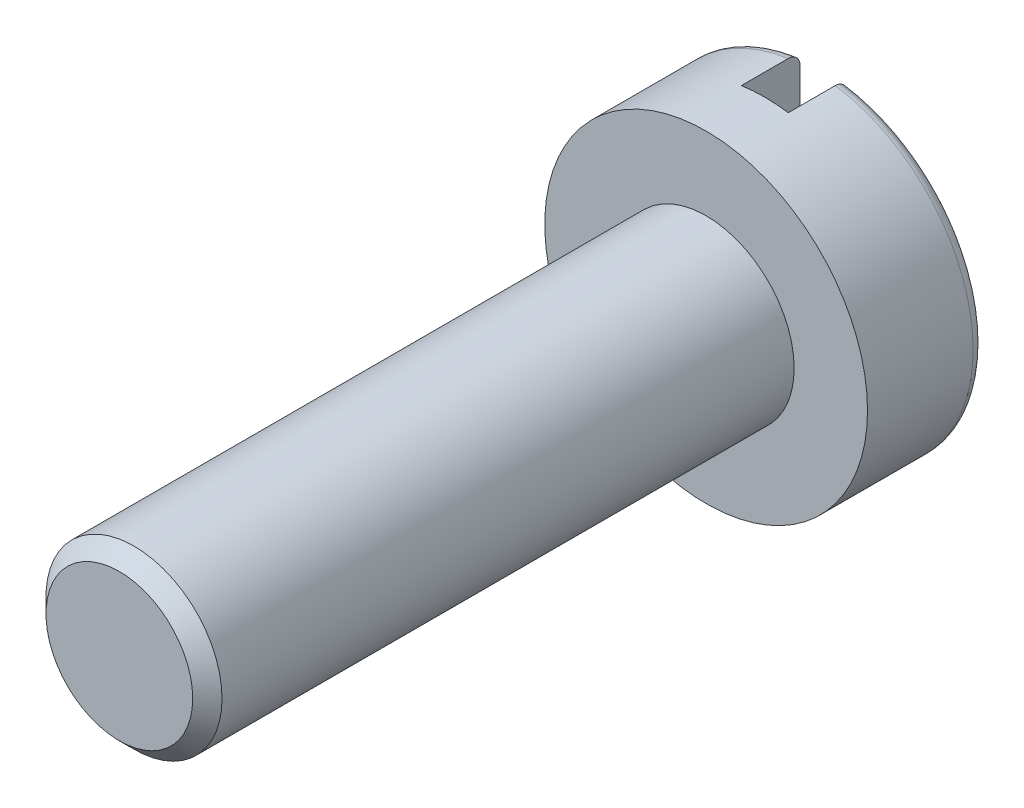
ISO-10303-21;
HEADER;
FILE_DESCRIPTION(('STEP AP214'),'2;1');
FILE_NAME('part.step','',(''),(''),'','','');
FILE_SCHEMA(('AUTOMOTIVE_DESIGN { 1 0 10303 214 1 1 1 1 }'));
ENDSEC;
DATA;
#1=APPLICATION_CONTEXT('core data for automotive mechanical design processes');
#2=APPLICATION_PROTOCOL_DEFINITION('international standard','automotive_design',2000,#1);
#3=PRODUCT_CONTEXT('',#1,'mechanical');
#4=PRODUCT('Part','Part','',(#3));
#5=PRODUCT_RELATED_PRODUCT_CATEGORY('part','',(#4));
#6=PRODUCT_DEFINITION_FORMATION('','',#4);
#7=PRODUCT_DEFINITION_CONTEXT('part definition',#1,'design');
#8=PRODUCT_DEFINITION('design','',#6,#7);
#9=PRODUCT_DEFINITION_SHAPE('','',#8);
#10=(LENGTH_UNIT() NAMED_UNIT(*) SI_UNIT(.MILLI.,.METRE.));
#11=(NAMED_UNIT(*) PLANE_ANGLE_UNIT() SI_UNIT($,.RADIAN.));
#12=(NAMED_UNIT(*) SI_UNIT($,.STERADIAN.) SOLID_ANGLE_UNIT());
#13=UNCERTAINTY_MEASURE_WITH_UNIT(LENGTH_MEASURE(1.E-05),#10,'distance_accuracy_value','');
#14=(GEOMETRIC_REPRESENTATION_CONTEXT(3) GLOBAL_UNCERTAINTY_ASSIGNED_CONTEXT((#13)) GLOBAL_UNIT_ASSIGNED_CONTEXT((#10,
#11,#12)) REPRESENTATION_CONTEXT('',''));
#15=CARTESIAN_POINT('',(0.,0.,0.));
#16=DIRECTION('',(0.,0.,1.));
#17=DIRECTION('',(1.,0.,0.));
#18=AXIS2_PLACEMENT_3D('',#15,#16,#17);
#19=CARTESIAN_POINT('',(0.,0.,-2.));
#20=DIRECTION('',(0.,0.,1.));
#21=DIRECTION('',(1.,0.,0.));
#22=AXIS2_PLACEMENT_3D('',#19,#20,#21);
#23=PLANE('',#22);
#24=CARTESIAN_POINT('',(0.,0.,-2.));
#25=DIRECTION('',(0.,0.,1.));
#26=DIRECTION('',(1.,0.,0.));
#27=AXIS2_PLACEMENT_3D('',#24,#25,#26);
#28=CIRCLE('',#27,2.55);
#29=CARTESIAN_POINT('',(0.4,2.51843205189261,-2.));
#30=VERTEX_POINT('',#29);
#31=CARTESIAN_POINT('',(0.399999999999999,-2.51843205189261,-2.));
#32=VERTEX_POINT('',#31);
#33=EDGE_CURVE('E92',#30,#32,#28,.F.);
#34=ORIENTED_EDGE('',*,*,#33,.T.);
#35=DIRECTION('',(0.,-1.,0.));
#36=VECTOR('',#35,1.);
#37=CARTESIAN_POINT('',(0.4,2.75,-2.));
#38=LINE('',#37,#36);
#39=EDGE_CURVE('E80',#30,#32,#38,.T.);
#40=ORIENTED_EDGE('',*,*,#39,.F.);
#41=EDGE_LOOP('',(#34,#40));
#42=FACE_BOUND('',#41,.T.);
#43=ADVANCED_FACE('F26',(#42),#23,.F.);
#44=CARTESIAN_POINT('',(0.,0.,-1.8));
#45=DIRECTION('',(0.,0.,1.));
#46=DIRECTION('',(1.,0.,0.));
#47=AXIS2_PLACEMENT_3D('',#44,#45,#46);
#48=TOROIDAL_SURFACE('',#47,2.55,0.2);
#49=CARTESIAN_POINT('',(0.400000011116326,-2.65860933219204,-1.94425299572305));
#50=CARTESIAN_POINT('',(0.400000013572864,-2.66673946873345,-1.93653155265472));
#51=CARTESIAN_POINT('',(0.400000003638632,-2.67422805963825,-1.92812356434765));
#52=CARTESIAN_POINT('',(0.399999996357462,-2.68769669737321,-1.91016516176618));
#53=CARTESIAN_POINT('',(0.399999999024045,-2.69367511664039,-1.90061353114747));
#54=CARTESIAN_POINT('',(0.400000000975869,-2.703938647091,-1.88063967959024));
#55=CARTESIAN_POINT('',(0.400000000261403,-2.70822390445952,-1.87021753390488));
#56=CARTESIAN_POINT('',(0.399999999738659,-2.71497066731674,-1.84880138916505));
#57=CARTESIAN_POINT('',(0.399999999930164,-2.71743261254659,-1.83780752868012));
#58=CARTESIAN_POINT('',(0.400000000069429,-2.72045091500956,-1.81562649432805));
#59=CARTESIAN_POINT('',(0.400000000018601,-2.72101827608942,-1.80444081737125));
#60=CARTESIAN_POINT('',(0.399999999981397,-2.72026107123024,-1.78213351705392));
#61=CARTESIAN_POINT('',(0.399999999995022,-2.718936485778,-1.77101189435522));
#62=CARTESIAN_POINT('',(0.400000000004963,-2.71444187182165,-1.74918151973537));
#63=CARTESIAN_POINT('',(0.40000000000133,-2.7112771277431,-1.73847167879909));
#64=CARTESIAN_POINT('',(0.399999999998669,-2.70320081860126,-1.71773257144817));
#65=CARTESIAN_POINT('',(0.399999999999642,-2.69828924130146,-1.70770330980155));
#66=CARTESIAN_POINT('',(0.400000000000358,-2.68684325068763,-1.68856900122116));
#67=CARTESIAN_POINT('',(0.400000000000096,-2.68030303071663,-1.67946742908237));
#68=CARTESIAN_POINT('',(0.399999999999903,-2.66579978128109,-1.66247936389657));
#69=CARTESIAN_POINT('',(0.399999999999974,-2.65783669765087,-1.65459291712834));
#70=CARTESIAN_POINT('',(0.400000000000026,-2.64063985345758,-1.64018295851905));
#71=CARTESIAN_POINT('',(0.400000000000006,-2.63139548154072,-1.63367211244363));
#72=CARTESIAN_POINT('',(0.399999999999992,-2.61195448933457,-1.62227505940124));
#73=CARTESIAN_POINT('',(0.399999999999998,-2.60175781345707,-1.61738894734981));
#74=CARTESIAN_POINT('',(0.400000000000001,-2.58058150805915,-1.609323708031));
#75=CARTESIAN_POINT('',(0.4,-2.56959449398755,-1.60616396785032));
#76=CARTESIAN_POINT('',(0.399999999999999,-2.54724795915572,-1.60171557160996));
#77=CARTESIAN_POINT('',(0.399999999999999,-2.53588841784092,-1.60042701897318));
#78=CARTESIAN_POINT('',(0.4,-2.51301035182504,-1.59974960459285));
#79=CARTESIAN_POINT('',(0.4,-2.50149131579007,-1.60037791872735));
#80=CARTESIAN_POINT('',(0.399999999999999,-2.47872055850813,-1.60355343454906));
#81=CARTESIAN_POINT('',(0.399999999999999,-2.46746884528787,-1.60610069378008));
#82=CARTESIAN_POINT('',(0.399999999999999,-2.4455202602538,-1.61305571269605));
#83=CARTESIAN_POINT('',(0.399999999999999,-2.43482505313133,-1.61746873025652));
#84=CARTESIAN_POINT('',(0.399999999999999,-2.41433282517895,-1.62803723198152));
#85=CARTESIAN_POINT('',(0.399999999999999,-2.40453578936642,-1.63419268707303));
#86=CARTESIAN_POINT('',(0.399999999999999,-2.38617960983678,-1.64803967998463));
#87=CARTESIAN_POINT('',(0.399999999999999,-2.37761393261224,-1.65572255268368));
#88=CARTESIAN_POINT('',(0.399999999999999,-2.36191367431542,-1.67243328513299));
#89=CARTESIAN_POINT('',(0.399999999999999,-2.35477900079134,-1.68146105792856));
#90=CARTESIAN_POINT('',(0.399999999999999,-2.34223853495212,-1.70048776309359));
#91=CARTESIAN_POINT('',(0.399999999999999,-2.33681259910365,-1.71047341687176));
#92=CARTESIAN_POINT('',(0.399999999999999,-2.32774037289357,-1.7312228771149));
#93=CARTESIAN_POINT('',(0.399999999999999,-2.32409393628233,-1.74198661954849));
#94=CARTESIAN_POINT('',(0.399999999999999,-2.31873231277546,-1.7638322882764));
#95=CARTESIAN_POINT('',(0.399999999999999,-2.31699201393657,-1.77490805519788));
#96=CARTESIAN_POINT('',(0.4,-2.31541092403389,-1.79719413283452));
#97=CARTESIAN_POINT('',(0.4,-2.31557003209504,-1.80840443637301));
#98=CARTESIAN_POINT('',(0.399999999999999,-2.31777431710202,-1.83055416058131));
#99=CARTESIAN_POINT('',(0.399999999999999,-2.31980560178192,-1.84149496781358));
#100=CARTESIAN_POINT('',(0.4,-2.32567160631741,-1.86288155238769));
#101=CARTESIAN_POINT('',(0.400000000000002,-2.3295063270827,-1.87332732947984));
#102=CARTESIAN_POINT('',(0.399999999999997,-2.33887482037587,-1.89345961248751));
#103=CARTESIAN_POINT('',(0.399999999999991,-2.34441300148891,-1.90314406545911));
#104=CARTESIAN_POINT('',(0.400000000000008,-2.3570198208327,-1.92145915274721));
#105=CARTESIAN_POINT('',(0.400000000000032,-2.36408853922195,-1.93008973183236));
#106=CARTESIAN_POINT('',(0.399999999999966,-2.37963706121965,-1.94615549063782));
#107=CARTESIAN_POINT('',(0.399999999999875,-2.38813155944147,-1.95357644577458));
#108=CARTESIAN_POINT('',(0.400000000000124,-2.40623156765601,-1.9669099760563));
#109=CARTESIAN_POINT('',(0.400000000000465,-2.4158371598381,-1.97282243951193));
#110=CARTESIAN_POINT('',(0.399999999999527,-2.43602723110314,-1.98305471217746));
#111=CARTESIAN_POINT('',(0.399999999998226,-2.44662325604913,-1.98735174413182));
#112=CARTESIAN_POINT('',(0.400000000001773,-2.46838173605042,-1.99412509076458));
#113=CARTESIAN_POINT('',(0.400000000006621,-2.47954420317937,-1.99660136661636));
#114=CARTESIAN_POINT('',(0.399999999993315,-2.50223318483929,-1.99968254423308));
#115=CARTESIAN_POINT('',(0.39999999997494,-2.51376215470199,-2.00026939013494));
#116=CARTESIAN_POINT('',(0.400000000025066,-2.53675880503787,-1.99950312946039));
#117=CARTESIAN_POINT('',(0.40000000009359,-2.54822646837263,-1.99814950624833));
#118=CARTESIAN_POINT('',(0.3999999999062,-2.57079631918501,-1.99353077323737));
#119=CARTESIAN_POINT('',(0.399999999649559,-2.58189763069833,-1.99026138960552));
#120=CARTESIAN_POINT('',(0.400000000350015,-2.60337875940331,-1.9818953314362));
#121=CARTESIAN_POINT('',(0.400000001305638,-2.61375943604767,-1.97680087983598));
#122=CARTESIAN_POINT('',(0.399999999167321,-2.62991906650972,-1.96708381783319));
#123=CARTESIAN_POINT('',(0.399999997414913,-2.63600280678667,-1.96295878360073));
#124=CARTESIAN_POINT('',(0.400000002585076,-2.64768585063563,-1.9540716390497));
#125=CARTESIAN_POINT('',(0.400000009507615,-2.65328515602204,-1.94930953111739));
#126=CARTESIAN_POINT('',(0.400000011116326,-2.65860933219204,-1.94425299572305));
#127=B_SPLINE_CURVE_WITH_KNOTS('',3,(#49,#50,#51,#52,#53,#54,#55,#56,#57,#58,#59,#60,#61,#62,
#63,#64,#65,#66,#67,#68,#69,#70,#71,#72,#73,#74,#75,#76,#77,#78,#79,#80,#81,#82,#83,#84,#85,#86,
#87,#88,#89,#90,#91,#92,#93,#94,#95,#96,#97,#98,#99,#100,#101,#102,#103,#104,#105,#106,#107,
#108,#109,#110,#111,#112,#113,#114,#115,#116,#117,#118,#119,#120,#121,#122,#123,#124,#125,#126),
.UNSPECIFIED.,.T.,.F.,(4,2,2,2,2,2,2,2,2,2,2,2,2,2,2,2,2,2,2,2,2,2,2,2,2,2,2,2,2,2,2,2,2,2,2,2,
2,2,4),(0.,0.0336109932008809,0.0672580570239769,0.100902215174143,0.13453825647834,
0.16797859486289,0.201419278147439,0.23476440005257,0.268109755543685,0.301575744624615,
0.335043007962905,0.368806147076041,0.402571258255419,0.436708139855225,0.470846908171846,
0.505292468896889,0.539739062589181,0.574283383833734,0.608827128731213,0.643180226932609,
0.677531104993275,0.711460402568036,0.745386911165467,0.778860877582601,0.812333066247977,
0.845558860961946,0.878784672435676,0.912097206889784,0.945411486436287,0.979092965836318,
1.01277693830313,1.04691946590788,1.0810627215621,1.11553130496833,1.15000906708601,
1.18456403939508,1.21907706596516,1.24108795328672,1.26309875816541),.UNSPECIFIED.);
#128=CARTESIAN_POINT('',(0.399999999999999,-2.7207535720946,-1.80000000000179));
#129=VERTEX_POINT('',#128);
#130=EDGE_CURVE('E49',#32,#129,#127,.T.);
#131=ORIENTED_EDGE('',*,*,#130,.F.);
#132=ORIENTED_EDGE('',*,*,#33,.F.);
#133=CARTESIAN_POINT('',(0.4,2.3572487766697,-1.92125081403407));
#134=CARTESIAN_POINT('',(0.4,2.35042520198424,-1.91242518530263));
#135=CARTESIAN_POINT('',(0.4,2.34433546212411,-1.90302277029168));
#136=CARTESIAN_POINT('',(0.4,2.33381210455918,-1.88332346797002));
#137=CARTESIAN_POINT('',(0.4,2.32938021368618,-1.87302566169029));
#138=CARTESIAN_POINT('',(0.4,2.32231422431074,-1.85182953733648));
#139=CARTESIAN_POINT('',(0.4,2.31968007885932,-1.84093123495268));
#140=CARTESIAN_POINT('',(0.4,2.31629312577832,-1.81884868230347));
#141=CARTESIAN_POINT('',(0.4,2.31553986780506,-1.80766450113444));
#142=CARTESIAN_POINT('',(0.4,2.31593560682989,-1.78540063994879));
#143=CARTESIAN_POINT('',(0.4,2.31707264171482,-1.7743207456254));
#144=CARTESIAN_POINT('',(0.4,2.32119089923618,-1.7525091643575));
#145=CARTESIAN_POINT('',(0.4,2.32417216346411,-1.74177748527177));
#146=CARTESIAN_POINT('',(0.4,2.3318876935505,-1.7209629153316));
#147=CARTESIAN_POINT('',(0.4,2.3366221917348,-1.71088011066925));
#148=CARTESIAN_POINT('',(0.4,2.34770152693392,-1.69164234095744));
#149=CARTESIAN_POINT('',(0.4,2.35404642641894,-1.68248741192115));
#150=CARTESIAN_POINT('',(0.4,2.36822737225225,-1.66527057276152));
#151=CARTESIAN_POINT('',(0.4,2.3760769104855,-1.6572197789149));
#152=CARTESIAN_POINT('',(0.4,2.39300010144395,-1.64252860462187));
#153=CARTESIAN_POINT('',(0.4,2.40207383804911,-1.63588832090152));
#154=CARTESIAN_POINT('',(0.4,2.42132029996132,-1.62411136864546));
#155=CARTESIAN_POINT('',(0.4,2.43150630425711,-1.61899639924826));
#156=CARTESIAN_POINT('',(0.4,2.45258587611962,-1.61052751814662));
#157=CARTESIAN_POINT('',(0.4,2.46347949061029,-1.60717372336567));
#158=CARTESIAN_POINT('',(0.4,2.4857948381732,-1.60228808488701));
#159=CARTESIAN_POINT('',(0.4,2.49722108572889,-1.60077684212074));
#160=CARTESIAN_POINT('',(0.4,2.520165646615,-1.59968592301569));
#161=CARTESIAN_POINT('',(0.4,2.53168396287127,-1.60010630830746));
#162=CARTESIAN_POINT('',(0.4,2.55453141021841,-1.60287503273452));
#163=CARTESIAN_POINT('',(0.4,2.56585965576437,-1.60523069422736));
#164=CARTESIAN_POINT('',(0.4,2.58795699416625,-1.6118186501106));
#165=CARTESIAN_POINT('',(0.4,2.59872609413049,-1.61605092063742));
#166=CARTESIAN_POINT('',(0.4,2.61934690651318,-1.62625658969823));
#167=CARTESIAN_POINT('',(0.4,2.62920241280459,-1.63222231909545));
#168=CARTESIAN_POINT('',(0.4,2.64775887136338,-1.64573924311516));
#169=CARTESIAN_POINT('',(0.4,2.6564598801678,-1.65329036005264));
#170=CARTESIAN_POINT('',(0.4,2.67236752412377,-1.6696850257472));
#171=CARTESIAN_POINT('',(0.4,2.67958804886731,-1.67851509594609));
#172=CARTESIAN_POINT('',(0.4,2.69242457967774,-1.69727337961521));
#173=CARTESIAN_POINT('',(0.4,2.69804068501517,-1.70720152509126));
#174=CARTESIAN_POINT('',(0.4,2.70744518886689,-1.72775711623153));
#175=CARTESIAN_POINT('',(0.4,2.71125291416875,-1.73837572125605));
#176=CARTESIAN_POINT('',(0.4,2.71701577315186,-1.76010422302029));
#177=CARTESIAN_POINT('',(0.4,2.71897099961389,-1.77121409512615));
#178=CARTESIAN_POINT('',(0.4,2.72096148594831,-1.79351684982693));
#179=CARTESIAN_POINT('',(0.4,2.72101160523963,-1.80470840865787));
#180=CARTESIAN_POINT('',(0.4,2.71922804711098,-1.82694020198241));
#181=CARTESIAN_POINT('',(0.4,2.71739440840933,-1.83798043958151));
#182=CARTESIAN_POINT('',(0.4,2.71190407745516,-1.85957433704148));
#183=CARTESIAN_POINT('',(0.4,2.70825098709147,-1.8701289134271));
#184=CARTESIAN_POINT('',(0.4,2.69923229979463,-1.89047879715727));
#185=CARTESIAN_POINT('',(0.4,2.69386668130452,-1.90027409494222));
#186=CARTESIAN_POINT('',(0.4,2.68155301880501,-1.91887618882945));
#187=CARTESIAN_POINT('',(0.4,2.67459804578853,-1.92767839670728));
#188=CARTESIAN_POINT('',(0.4,2.65932154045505,-1.94400371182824));
#189=CARTESIAN_POINT('',(0.4,2.65099994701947,-1.95152676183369));
#190=CARTESIAN_POINT('',(0.4,2.63314434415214,-1.96515657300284));
#191=CARTESIAN_POINT('',(0.4,2.62359972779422,-1.97124943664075));
#192=CARTESIAN_POINT('',(0.4,2.60363175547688,-1.98176651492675));
#193=CARTESIAN_POINT('',(0.4,2.59320834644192,-1.98619062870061));
#194=CARTESIAN_POINT('',(0.4,2.57165575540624,-1.99329508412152));
#195=CARTESIAN_POINT('',(0.4,2.56052006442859,-1.99595568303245));
#196=CARTESIAN_POINT('',(0.4,2.53796154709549,-1.99938670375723));
#197=CARTESIAN_POINT('',(0.4,2.52653871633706,-2.0001570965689));
#198=CARTESIAN_POINT('',(0.4,2.50362920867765,-1.99978824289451));
#199=CARTESIAN_POINT('',(0.4,2.49214278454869,-1.99863315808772));
#200=CARTESIAN_POINT('',(0.4,2.46952246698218,-1.99441433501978));
#201=CARTESIAN_POINT('',(0.4,2.45838866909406,-1.99135008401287));
#202=CARTESIAN_POINT('',(0.4,2.43677018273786,-1.98338670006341));
#203=CARTESIAN_POINT('',(0.4,2.42628699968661,-1.97848348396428));
#204=CARTESIAN_POINT('',(0.4,2.406309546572,-1.96697813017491));
#205=CARTESIAN_POINT('',(0.4,2.39681409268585,-1.96037805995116));
#206=CARTESIAN_POINT('',(0.4,2.38227382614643,-1.94831108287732));
#207=CARTESIAN_POINT('',(0.4,2.37685482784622,-1.94328770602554));
#208=CARTESIAN_POINT('',(0.4,2.36659972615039,-1.93267732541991));
#209=CARTESIAN_POINT('',(0.4,2.36176362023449,-1.92709032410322));
#210=CARTESIAN_POINT('',(0.4,2.3572487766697,-1.92125081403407));
#211=B_SPLINE_CURVE_WITH_KNOTS('',3,(#133,#134,#135,#136,#137,#138,#139,#140,#141,#142,#143,
#144,#145,#146,#147,#148,#149,#150,#151,#152,#153,#154,#155,#156,#157,#158,#159,#160,#161,#162,
#163,#164,#165,#166,#167,#168,#169,#170,#171,#172,#173,#174,#175,#176,#177,#178,#179,#180,#181,
#182,#183,#184,#185,#186,#187,#188,#189,#190,#191,#192,#193,#194,#195,#196,#197,#198,#199,#200,
#201,#202,#203,#204,#205,#206,#207,#208,#209,#210),.UNSPECIFIED.,.T.,.F.,(4,2,2,2,2,2,2,2,2,2,2,
2,2,2,2,2,2,2,2,2,2,2,2,2,2,2,2,2,2,2,2,2,2,2,2,2,2,2,4),(0.,0.0334410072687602,
0.0669167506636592,0.100391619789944,0.133858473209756,0.167114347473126,0.200370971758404,
0.23363200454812,0.26689432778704,0.300470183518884,0.334048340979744,0.368083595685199,
0.402121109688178,0.43653579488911,0.470951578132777,0.505498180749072,0.540044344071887,
0.574439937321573,0.608833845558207,0.642888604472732,0.676941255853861,0.710621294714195,
0.744299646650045,0.777715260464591,0.81113018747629,0.844479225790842,0.877828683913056,
0.911326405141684,0.944825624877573,0.978638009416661,1.01245243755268,1.04663930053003,
1.08082668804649,1.11529667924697,1.14977593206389,1.18433219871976,1.21884655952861,
1.24097302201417,1.26309938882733),.UNSPECIFIED.);
#212=CARTESIAN_POINT('',(0.4,2.72075357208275,-1.79999999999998));
#213=VERTEX_POINT('',#212);
#214=EDGE_CURVE('E77',#213,#30,#211,.T.);
#215=ORIENTED_EDGE('',*,*,#214,.F.);
#216=CARTESIAN_POINT('',(0.,0.,-1.8));
#217=DIRECTION('',(0.,0.,1.));
#218=DIRECTION('',(1.,0.,0.));
#219=AXIS2_PLACEMENT_3D('',#216,#217,#218);
#220=CIRCLE('',#219,2.75);
#221=EDGE_CURVE('E101',#129,#213,#220,.T.);
#222=ORIENTED_EDGE('',*,*,#221,.F.);
#223=EDGE_LOOP('',(#131,#132,#215,#222));
#224=FACE_BOUND('',#223,.T.);
#225=ADVANCED_FACE('F94',(#224),#48,.T.);
#226=CARTESIAN_POINT('',(0.,0.,0.));
#227=DIRECTION('',(0.,0.,1.));
#228=DIRECTION('',(1.,0.,0.));
#229=AXIS2_PLACEMENT_3D('',#226,#227,#228);
#230=PLANE('',#229);
#231=CARTESIAN_POINT('',(0.,0.,0.));
#232=DIRECTION('',(0.,0.,1.));
#233=DIRECTION('',(1.,0.,0.));
#234=AXIS2_PLACEMENT_3D('',#231,#232,#233);
#235=CIRCLE('',#234,2.75);
#236=CARTESIAN_POINT('',(2.75,0.,0.));
#237=VERTEX_POINT('',#236);
#238=EDGE_CURVE('E154',#237,#237,#235,.T.);
#239=ORIENTED_EDGE('',*,*,#238,.T.);
#240=EDGE_LOOP('',(#239));
#241=FACE_BOUND('',#240,.T.);
#242=CARTESIAN_POINT('',(0.,0.,0.));
#243=DIRECTION('',(0.,0.,1.));
#244=DIRECTION('',(1.,0.,0.));
#245=AXIS2_PLACEMENT_3D('',#242,#243,#244);
#246=CIRCLE('',#245,1.5);
#247=CARTESIAN_POINT('',(1.5,0.,0.));
#248=VERTEX_POINT('',#247);
#249=EDGE_CURVE('E151',#248,#248,#246,.T.);
#250=ORIENTED_EDGE('',*,*,#249,.F.);
#251=EDGE_LOOP('',(#250));
#252=FACE_BOUND('',#251,.T.);
#253=ADVANCED_FACE('F177',(#241,#252),#230,.T.);
#254=CARTESIAN_POINT('',(0.,0.,-2.));
#255=DIRECTION('',(0.,0.,1.));
#256=DIRECTION('',(1.,0.,0.));
#257=AXIS2_PLACEMENT_3D('',#254,#255,#256);
#258=CYLINDRICAL_SURFACE('',#257,2.75);
#259=DIRECTION('',(0.,0.,1.));
#260=VECTOR('',#259,1.);
#261=CARTESIAN_POINT('',(0.399999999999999,-2.72075357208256,-2.));
#262=LINE('',#261,#260);
#263=CARTESIAN_POINT('',(0.399999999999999,-2.72075357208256,-1.));
#264=VERTEX_POINT('',#263);
#265=EDGE_CURVE('E141',#129,#264,#262,.T.);
#266=ORIENTED_EDGE('',*,*,#265,.F.);
#267=ORIENTED_EDGE('',*,*,#221,.T.);
#268=DIRECTION('',(0.,0.,1.));
#269=VECTOR('',#268,1.);
#270=CARTESIAN_POINT('',(0.4,2.72075357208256,-2.));
#271=LINE('',#270,#269);
#272=CARTESIAN_POINT('',(0.4,2.72075357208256,-1.));
#273=VERTEX_POINT('',#272);
#274=EDGE_CURVE('E83',#273,#213,#271,.F.);
#275=ORIENTED_EDGE('',*,*,#274,.F.);
#276=CARTESIAN_POINT('',(0.,0.,-1.));
#277=DIRECTION('',(0.,0.,-1.));
#278=DIRECTION('',(-1.,0.,0.));
#279=AXIS2_PLACEMENT_3D('',#276,#277,#278);
#280=CIRCLE('',#279,2.75);
#281=CARTESIAN_POINT('',(-0.4,2.72075357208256,-1.));
#282=VERTEX_POINT('',#281);
#283=EDGE_CURVE('E30',#273,#282,#280,.F.);
#284=ORIENTED_EDGE('',*,*,#283,.T.);
#285=DIRECTION('',(0.,0.,1.));
#286=VECTOR('',#285,1.);
#287=CARTESIAN_POINT('',(-0.4,2.72075357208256,-2.));
#288=LINE('',#287,#286);
#289=CARTESIAN_POINT('',(-0.4,2.72075357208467,-1.80000000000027));
#290=VERTEX_POINT('',#289);
#291=EDGE_CURVE('E133',#290,#282,#288,.T.);
#292=ORIENTED_EDGE('',*,*,#291,.F.);
#293=CARTESIAN_POINT('',(-0.400000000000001,-2.72075357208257,-1.8));
#294=VERTEX_POINT('',#293);
#295=EDGE_CURVE('E96',#290,#294,#220,.T.);
#296=ORIENTED_EDGE('',*,*,#295,.T.);
#297=DIRECTION('',(0.,0.,1.));
#298=VECTOR('',#297,1.);
#299=CARTESIAN_POINT('',(-0.400000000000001,-2.72075357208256,-2.));
#300=LINE('',#299,#298);
#301=CARTESIAN_POINT('',(-0.400000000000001,-2.72075357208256,-1.));
#302=VERTEX_POINT('',#301);
#303=EDGE_CURVE('E147',#302,#294,#300,.F.);
#304=ORIENTED_EDGE('',*,*,#303,.F.);
#305=EDGE_CURVE('E11',#302,#264,#280,.F.);
#306=ORIENTED_EDGE('',*,*,#305,.T.);
#307=EDGE_LOOP('',(#266,#267,#275,#284,#292,#296,#304,#306));
#308=FACE_BOUND('',#307,.T.);
#309=ORIENTED_EDGE('',*,*,#238,.F.);
#310=EDGE_LOOP('',(#309));
#311=FACE_BOUND('',#310,.T.);
#312=ADVANCED_FACE('F28',(#308,#311),#258,.T.);
#313=CARTESIAN_POINT('',(-0.400000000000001,-2.51843205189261,-2.));
#314=VERTEX_POINT('',#313);
#315=CARTESIAN_POINT('',(-0.4,2.51843205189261,-2.));
#316=VERTEX_POINT('',#315);
#317=EDGE_CURVE('E95',#314,#316,#28,.F.);
#318=ORIENTED_EDGE('',*,*,#317,.T.);
#319=DIRECTION('',(0.,1.,0.));
#320=VECTOR('',#319,1.);
#321=CARTESIAN_POINT('',(-0.4,2.75,-2.));
#322=LINE('',#321,#320);
#323=EDGE_CURVE('E41',#314,#316,#322,.T.);
#324=ORIENTED_EDGE('',*,*,#323,.F.);
#325=EDGE_LOOP('',(#318,#324));
#326=FACE_BOUND('',#325,.T.);
#327=ADVANCED_FACE('F168',(#326),#23,.F.);
#328=CARTESIAN_POINT('',(0.,0.,10.));
#329=DIRECTION('',(0.,0.,-1.));
#330=DIRECTION('',(-1.,0.,0.));
#331=AXIS2_PLACEMENT_3D('',#328,#329,#330);
#332=CYLINDRICAL_SURFACE('',#331,1.5);
#333=CARTESIAN_POINT('',(0.,0.,9.75));
#334=DIRECTION('',(0.,0.,1.));
#335=DIRECTION('',(1.,0.,0.));
#336=AXIS2_PLACEMENT_3D('',#333,#334,#335);
#337=CIRCLE('',#336,1.5);
#338=CARTESIAN_POINT('',(1.5,0.,9.75));
#339=VERTEX_POINT('',#338);
#340=EDGE_CURVE('E159',#339,#339,#337,.F.);
#341=ORIENTED_EDGE('',*,*,#340,.T.);
#342=EDGE_LOOP('',(#341));
#343=FACE_BOUND('',#342,.T.);
#344=ORIENTED_EDGE('',*,*,#249,.T.);
#345=EDGE_LOOP('',(#344));
#346=FACE_BOUND('',#345,.T.);
#347=ADVANCED_FACE('F170',(#343,#346),#332,.T.);
#348=CARTESIAN_POINT('',(0.,0.,10.));
#349=DIRECTION('',(0.,0.,1.));
#350=DIRECTION('',(1.,0.,0.));
#351=AXIS2_PLACEMENT_3D('',#348,#349,#350);
#352=PLANE('',#351);
#353=CARTESIAN_POINT('',(0.,0.,10.));
#354=DIRECTION('',(0.,0.,1.));
#355=DIRECTION('',(1.,0.,0.));
#356=AXIS2_PLACEMENT_3D('',#353,#354,#355);
#357=CIRCLE('',#356,1.25);
#358=CARTESIAN_POINT('',(1.25,0.,10.));
#359=VERTEX_POINT('',#358);
#360=EDGE_CURVE('E157',#359,#359,#357,.T.);
#361=ORIENTED_EDGE('',*,*,#360,.T.);
#362=EDGE_LOOP('',(#361));
#363=FACE_BOUND('',#362,.T.);
#364=ADVANCED_FACE('F175',(#363),#352,.T.);
#365=CARTESIAN_POINT('',(0.,0.,10.));
#366=DIRECTION('',(0.,0.,-1.));
#367=DIRECTION('',(-1.,0.,0.));
#368=AXIS2_PLACEMENT_3D('',#365,#366,#367);
#369=CONICAL_SURFACE('',#368,1.25,0.785398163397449);
#370=ORIENTED_EDGE('',*,*,#340,.F.);
#371=EDGE_LOOP('',(#370));
#372=FACE_BOUND('',#371,.T.);
#373=ORIENTED_EDGE('',*,*,#360,.F.);
#374=EDGE_LOOP('',(#373));
#375=FACE_BOUND('',#374,.T.);
#376=ADVANCED_FACE('F188',(#372,#375),#369,.T.);
#377=CARTESIAN_POINT('',(-0.400000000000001,-2.65860932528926,-1.94425298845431));
#378=CARTESIAN_POINT('',(-0.400000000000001,-2.65034808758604,-1.95209755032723));
#379=CARTESIAN_POINT('',(-0.400000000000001,-2.64141239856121,-1.95924476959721));
#380=CARTESIAN_POINT('',(-0.400000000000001,-2.62245759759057,-1.97193932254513));
#381=CARTESIAN_POINT('',(-0.400000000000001,-2.61243704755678,-1.9774844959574));
#382=CARTESIAN_POINT('',(-0.400000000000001,-2.5916177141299,-1.986814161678));
#383=CARTESIAN_POINT('',(-0.400000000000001,-2.58081965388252,-1.99060026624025));
#384=CARTESIAN_POINT('',(-0.400000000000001,-2.5587471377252,-1.99631915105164));
#385=CARTESIAN_POINT('',(-0.400000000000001,-2.54747280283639,-1.99825239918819));
#386=CARTESIAN_POINT('',(-0.400000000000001,-2.52467780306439,-2.0002263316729));
#387=CARTESIAN_POINT('',(-0.400000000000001,-2.51315595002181,-2.00025331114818));
#388=CARTESIAN_POINT('',(-0.400000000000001,-2.4902690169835,-1.99838125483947));
#389=CARTESIAN_POINT('',(-0.400000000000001,-2.47890394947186,-1.99648206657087));
#390=CARTESIAN_POINT('',(-0.400000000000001,-2.4566057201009,-1.99079704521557));
#391=CARTESIAN_POINT('',(-0.400000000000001,-2.44567452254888,-1.98700350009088));
#392=CARTESIAN_POINT('',(-0.400000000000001,-2.42460769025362,-1.97762786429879));
#393=CARTESIAN_POINT('',(-0.400000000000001,-2.41447204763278,-1.97204579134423));
#394=CARTESIAN_POINT('',(-0.400000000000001,-2.39533207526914,-1.95927080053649));
#395=CARTESIAN_POINT('',(-0.400000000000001,-2.3863232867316,-1.95208456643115));
#396=CARTESIAN_POINT('',(-0.400000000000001,-2.3696574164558,-1.9362857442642));
#397=CARTESIAN_POINT('',(-0.400000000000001,-2.36200025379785,-1.92767324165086));
#398=CARTESIAN_POINT('',(-0.400000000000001,-2.34835089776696,-1.90937010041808));
#399=CARTESIAN_POINT('',(-0.400000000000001,-2.34234066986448,-1.89969291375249));
#400=CARTESIAN_POINT('',(-0.400000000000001,-2.33205641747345,-1.87945609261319));
#401=CARTESIAN_POINT('',(-0.400000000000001,-2.32778225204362,-1.86889652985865));
#402=CARTESIAN_POINT('',(-0.400000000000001,-2.32115101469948,-1.84734997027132));
#403=CARTESIAN_POINT('',(-0.400000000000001,-2.31876853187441,-1.8363707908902));
#404=CARTESIAN_POINT('',(-0.400000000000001,-2.31589888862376,-1.81416766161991));
#405=CARTESIAN_POINT('',(-0.400000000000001,-2.31541161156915,-1.80294372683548));
#406=CARTESIAN_POINT('',(-0.400000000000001,-2.31634340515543,-1.78067462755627));
#407=CARTESIAN_POINT('',(-0.400000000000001,-2.31774575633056,-1.76962875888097));
#408=CARTESIAN_POINT('',(-0.400000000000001,-2.32238371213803,-1.74792919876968));
#409=CARTESIAN_POINT('',(-0.400000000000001,-2.32561930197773,-1.73727550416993));
#410=CARTESIAN_POINT('',(-0.400000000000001,-2.33382811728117,-1.7166498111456));
#411=CARTESIAN_POINT('',(-0.400000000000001,-2.33880285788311,-1.70667841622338));
#412=CARTESIAN_POINT('',(-0.400000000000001,-2.35033999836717,-1.68770123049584));
#413=CARTESIAN_POINT('',(-0.400000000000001,-2.35690246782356,-1.67869548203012));
#414=CARTESIAN_POINT('',(-0.400000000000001,-2.37149573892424,-1.66180738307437));
#415=CARTESIAN_POINT('',(-0.400000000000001,-2.37954047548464,-1.65393707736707));
#416=CARTESIAN_POINT('',(-0.400000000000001,-2.39682146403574,-1.63963659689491));
#417=CARTESIAN_POINT('',(-0.400000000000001,-2.40605780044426,-1.63320652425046));
#418=CARTESIAN_POINT('',(-0.400000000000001,-2.42559509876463,-1.62187689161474));
#419=CARTESIAN_POINT('',(-0.400000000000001,-2.43590887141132,-1.6169994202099));
#420=CARTESIAN_POINT('',(-0.400000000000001,-2.45720301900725,-1.60902420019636));
#421=CARTESIAN_POINT('',(-0.400000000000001,-2.46818343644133,-1.60592656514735));
#422=CARTESIAN_POINT('',(-0.400000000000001,-2.49062521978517,-1.60156919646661));
#423=CARTESIAN_POINT('',(-0.400000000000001,-2.50209046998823,-1.60032944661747));
#424=CARTESIAN_POINT('',(-0.400000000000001,-2.52506704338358,-1.59978543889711));
#425=CARTESIAN_POINT('',(-0.400000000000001,-2.53657836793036,-1.60048123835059));
#426=CARTESIAN_POINT('',(-0.400000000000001,-2.55935849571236,-1.60379751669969));
#427=CARTESIAN_POINT('',(-0.400000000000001,-2.57062640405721,-1.60642415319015));
#428=CARTESIAN_POINT('',(-0.400000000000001,-2.59255780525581,-1.61354099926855));
#429=CARTESIAN_POINT('',(-0.400000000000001,-2.60322130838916,-1.61803117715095));
#430=CARTESIAN_POINT('',(-0.400000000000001,-2.62358334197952,-1.62872838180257));
#431=CARTESIAN_POINT('',(-0.400000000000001,-2.63328631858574,-1.63492694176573));
#432=CARTESIAN_POINT('',(-0.400000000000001,-2.65150010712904,-1.64888066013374));
#433=CARTESIAN_POINT('',(-0.400000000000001,-2.66001097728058,-1.65663574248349));
#434=CARTESIAN_POINT('',(-0.400000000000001,-2.67550618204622,-1.6733993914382));
#435=CARTESIAN_POINT('',(-0.400000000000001,-2.68250505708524,-1.68239451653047));
#436=CARTESIAN_POINT('',(-0.400000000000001,-2.69487364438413,-1.70144279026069));
#437=CARTESIAN_POINT('',(-0.400000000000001,-2.70024345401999,-1.71149587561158));
#438=CARTESIAN_POINT('',(-0.400000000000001,-2.70914143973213,-1.73225739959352));
#439=CARTESIAN_POINT('',(-0.400000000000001,-2.71268892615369,-1.74295756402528));
#440=CARTESIAN_POINT('',(-0.400000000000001,-2.71792179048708,-1.76480341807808));
#441=CARTESIAN_POINT('',(-0.400000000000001,-2.71960733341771,-1.77594906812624));
#442=CARTESIAN_POINT('',(-0.400000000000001,-2.72105982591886,-1.79827969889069));
#443=CARTESIAN_POINT('',(-0.400000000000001,-2.72084118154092,-1.80946374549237));
#444=CARTESIAN_POINT('',(-0.400000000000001,-2.71852583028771,-1.83163865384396));
#445=CARTESIAN_POINT('',(-0.400000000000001,-2.71642868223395,-1.84262946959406));
#446=CARTESIAN_POINT('',(-0.400000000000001,-2.71042288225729,-1.86409078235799));
#447=CARTESIAN_POINT('',(-0.400000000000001,-2.70651609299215,-1.87456180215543));
#448=CARTESIAN_POINT('',(-0.400000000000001,-2.69701008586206,-1.89469412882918));
#449=CARTESIAN_POINT('',(-0.400000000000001,-2.69141291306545,-1.90435639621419));
#450=CARTESIAN_POINT('',(-0.400000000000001,-2.68118404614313,-1.91904044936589));
#451=CARTESIAN_POINT('',(-0.400000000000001,-2.67702903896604,-1.92440077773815));
#452=CARTESIAN_POINT('',(-0.400000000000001,-2.66819867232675,-1.93467397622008));
#453=CARTESIAN_POINT('',(-0.400000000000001,-2.66352331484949,-1.93958684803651));
#454=CARTESIAN_POINT('',(-0.400000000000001,-2.65860932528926,-1.94425298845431));
#455=B_SPLINE_CURVE_WITH_KNOTS('',3,(#377,#378,#379,#380,#381,#382,#383,#384,#385,#386,#387,
#388,#389,#390,#391,#392,#393,#394,#395,#396,#397,#398,#399,#400,#401,#402,#403,#404,#405,#406,
#407,#408,#409,#410,#411,#412,#413,#414,#415,#416,#417,#418,#419,#420,#421,#422,#423,#424,#425,
#426,#427,#428,#429,#430,#431,#432,#433,#434,#435,#436,#437,#438,#439,#440,#441,#442,#443,#444,
#445,#446,#447,#448,#449,#450,#451,#452,#453,#454),.UNSPECIFIED.,.T.,.F.,(4,2,2,2,2,2,2,2,2,2,2,
2,2,2,2,2,2,2,2,2,2,2,2,2,2,2,2,2,2,2,2,2,2,2,2,2,2,2,4),(0.,0.03415193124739,0.068349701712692,
0.102516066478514,0.136673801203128,0.171077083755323,0.205483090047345,0.240030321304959,
0.274577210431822,0.308982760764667,0.343386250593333,0.377396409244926,0.411403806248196,
0.444946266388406,0.478486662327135,0.511732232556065,0.544977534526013,0.578251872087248,
0.611527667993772,0.645133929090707,0.678742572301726,0.712809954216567,0.746879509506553,
0.781312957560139,0.815747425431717,0.850292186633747,0.884836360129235,0.919212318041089,
0.953586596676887,0.987613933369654,1.0216392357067,1.05529613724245,1.08895005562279,
1.12234958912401,1.15575696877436,1.18913003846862,1.22246289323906,1.24277738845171,
1.26309180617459),.UNSPECIFIED.);
#456=EDGE_CURVE('E88',#294,#314,#455,.T.);
#457=ORIENTED_EDGE('',*,*,#456,.F.);
#458=ORIENTED_EDGE('',*,*,#295,.F.);
#459=CARTESIAN_POINT('',(-0.399999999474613,2.35724877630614,-1.92125081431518));
#460=CARTESIAN_POINT('',(-0.399999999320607,2.36420701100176,-1.93024896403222));
#461=CARTESIAN_POINT('',(-0.399999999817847,2.37193845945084,-1.93866057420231));
#462=CARTESIAN_POINT('',(-0.400000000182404,2.38871438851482,-1.95406906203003));
#463=CARTESIAN_POINT('',(-0.400000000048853,2.39776066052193,-1.96106397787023));
#464=CARTESIAN_POINT('',(-0.399999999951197,2.41688721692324,-1.97343506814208));
#465=CARTESIAN_POINT('',(-0.399999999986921,2.42696645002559,-1.97881286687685));
#466=CARTESIAN_POINT('',(-0.400000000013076,2.44787581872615,-1.98781470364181));
#467=CARTESIAN_POINT('',(-0.400000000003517,2.45870576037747,-1.99143919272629));
#468=CARTESIAN_POINT('',(-0.399999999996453,2.48091102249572,-1.9968649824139));
#469=CARTESIAN_POINT('',(-0.399999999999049,2.4922901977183,-1.99865051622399));
#470=CARTESIAN_POINT('',(-0.400000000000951,2.51518768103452,-2.00029536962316));
#471=CARTESIAN_POINT('',(-0.400000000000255,2.52670600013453,-2.00015453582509));
#472=CARTESIAN_POINT('',(-0.399999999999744,2.54960748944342,-1.99794312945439));
#473=CARTESIAN_POINT('',(-0.399999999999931,2.5609898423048,-1.99586407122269));
#474=CARTESIAN_POINT('',(-0.400000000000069,2.58324162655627,-1.98981730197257));
#475=CARTESIAN_POINT('',(-0.400000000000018,2.59411106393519,-1.98584961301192));
#476=CARTESIAN_POINT('',(-0.399999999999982,2.61498172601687,-1.97614983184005));
#477=CARTESIAN_POINT('',(-0.399999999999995,2.62498611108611,-1.97042454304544));
#478=CARTESIAN_POINT('',(-0.400000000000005,2.64387929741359,-1.95736020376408));
#479=CARTESIAN_POINT('',(-0.400000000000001,2.65276815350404,-1.95002123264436));
#480=CARTESIAN_POINT('',(-0.399999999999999,2.6690854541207,-1.93401205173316));
#481=CARTESIAN_POINT('',(-0.4,2.67652710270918,-1.92535530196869));
#482=CARTESIAN_POINT('',(-0.4,2.68983200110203,-1.90690349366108));
#483=CARTESIAN_POINT('',(-0.4,2.695695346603,-1.89710850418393));
#484=CARTESIAN_POINT('',(-0.4,2.70560982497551,-1.87677448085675));
#485=CARTESIAN_POINT('',(-0.4,2.70968021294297,-1.86624483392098));
#486=CARTESIAN_POINT('',(-0.4,2.71597899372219,-1.84464835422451));
#487=CARTESIAN_POINT('',(-0.4,2.7182074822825,-1.83358154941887));
#488=CARTESIAN_POINT('',(-0.4,2.72074412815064,-1.81132156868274));
#489=CARTESIAN_POINT('',(-0.4,2.72106777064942,-1.80013015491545));
#490=CARTESIAN_POINT('',(-0.4,2.71982645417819,-1.77785275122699));
#491=CARTESIAN_POINT('',(-0.4,2.71826153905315,-1.76676675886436));
#492=CARTESIAN_POINT('',(-0.4,2.71329648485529,-1.7450424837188));
#493=CARTESIAN_POINT('',(-0.4,2.70990082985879,-1.7344031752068));
#494=CARTESIAN_POINT('',(-0.4,2.70137844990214,-1.71384238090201));
#495=CARTESIAN_POINT('',(-0.4,2.69625170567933,-1.70392090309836));
#496=CARTESIAN_POINT('',(-0.4,2.68439412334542,-1.68503261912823));
#497=CARTESIAN_POINT('',(-0.4,2.6776569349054,-1.67606980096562));
#498=CARTESIAN_POINT('',(-0.4,2.66278591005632,-1.65938969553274));
#499=CARTESIAN_POINT('',(-0.4,2.65465201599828,-1.65167245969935));
#500=CARTESIAN_POINT('',(-0.4,2.63714067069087,-1.63762626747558));
#501=CARTESIAN_POINT('',(-0.4,2.62775258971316,-1.63131056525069));
#502=CARTESIAN_POINT('',(-0.4,2.60805857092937,-1.62032492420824));
#503=CARTESIAN_POINT('',(-0.4,2.59775258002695,-1.61565508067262));
#504=CARTESIAN_POINT('',(-0.4,2.57639376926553,-1.60804009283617));
#505=CARTESIAN_POINT('',(-0.4,2.56533397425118,-1.60511451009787));
#506=CARTESIAN_POINT('',(-0.4,2.54288175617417,-1.60114381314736));
#507=CARTESIAN_POINT('',(-0.4,2.53148931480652,-1.600098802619));
#508=CARTESIAN_POINT('',(-0.4,2.50858946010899,-1.59991378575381));
#509=CARTESIAN_POINT('',(-0.4,2.4970819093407,-1.60079044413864));
#510=CARTESIAN_POINT('',(-0.4,2.47437577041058,-1.60445822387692));
#511=CARTESIAN_POINT('',(-0.4,2.46317719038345,-1.60724939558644));
#512=CARTESIAN_POINT('',(-0.4,2.44138132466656,-1.61468013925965));
#513=CARTESIAN_POINT('',(-0.4,2.43078550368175,-1.61932401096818));
#514=CARTESIAN_POINT('',(-0.399999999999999,2.4105301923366,-1.63033507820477));
#515=CARTESIAN_POINT('',(-0.399999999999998,2.40087068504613,-1.63670224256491));
#516=CARTESIAN_POINT('',(-0.400000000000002,2.38282849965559,-1.65094241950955));
#517=CARTESIAN_POINT('',(-0.400000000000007,2.37443844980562,-1.65880608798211));
#518=CARTESIAN_POINT('',(-0.399999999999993,2.35911811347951,-1.67584628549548));
#519=CARTESIAN_POINT('',(-0.399999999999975,2.35218773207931,-1.68502272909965));
#520=CARTESIAN_POINT('',(-0.400000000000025,2.34007768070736,-1.70430572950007));
#521=CARTESIAN_POINT('',(-0.400000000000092,2.33487716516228,-1.71439919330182));
#522=CARTESIAN_POINT('',(-0.399999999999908,2.3262707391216,-1.73532379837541));
#523=CARTESIAN_POINT('',(-0.399999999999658,2.3228646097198,-1.74615484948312));
#524=CARTESIAN_POINT('',(-0.400000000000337,2.31798716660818,-1.76809303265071));
#525=CARTESIAN_POINT('',(-0.400000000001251,2.31649079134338,-1.77919459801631));
#526=CARTESIAN_POINT('',(-0.399999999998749,2.31539703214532,-1.80149376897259));
#527=CARTESIAN_POINT('',(-0.399999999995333,2.31580003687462,-1.81269139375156));
#528=CARTESIAN_POINT('',(-0.400000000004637,2.3184838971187,-1.83478598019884));
#529=CARTESIAN_POINT('',(-0.400000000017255,2.32075289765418,-1.84568439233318));
#530=CARTESIAN_POINT('',(-0.399999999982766,2.32708234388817,-1.86693765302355));
#531=CARTESIAN_POINT('',(-0.399999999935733,2.33114059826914,-1.87729314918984));
#532=CARTESIAN_POINT('',(-0.400000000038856,2.33898177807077,-1.89324062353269));
#533=CARTESIAN_POINT('',(-0.400000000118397,2.3422391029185,-1.89909711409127));
#534=CARTESIAN_POINT('',(-0.399999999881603,2.3493245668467,-1.91045375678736));
#535=CARTESIAN_POINT('',(-0.399999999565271,2.35315270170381,-1.91595391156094));
#536=CARTESIAN_POINT('',(-0.399999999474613,2.35724877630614,-1.92125081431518));
#537=B_SPLINE_CURVE_WITH_KNOTS('',3,(#459,#460,#461,#462,#463,#464,#465,#466,#467,#468,#469,
#470,#471,#472,#473,#474,#475,#476,#477,#478,#479,#480,#481,#482,#483,#484,#485,#486,#487,#488,
#489,#490,#491,#492,#493,#494,#495,#496,#497,#498,#499,#500,#501,#502,#503,#504,#505,#506,#507,
#508,#509,#510,#511,#512,#513,#514,#515,#516,#517,#518,#519,#520,#521,#522,#523,#524,#525,#526,
#527,#528,#529,#530,#531,#532,#533,#534,#535,#536),.UNSPECIFIED.,.T.,.F.,(4,2,2,2,2,2,2,2,2,2,2,
2,2,2,2,2,2,2,2,2,2,2,2,2,2,2,2,2,2,2,2,2,2,2,2,2,2,2,4),(0.,0.0340992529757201,
0.0682454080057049,0.102357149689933,0.136460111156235,0.170853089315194,0.205248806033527,
0.239795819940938,0.274342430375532,0.308756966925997,0.343169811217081,0.377252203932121,
0.411332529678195,0.445037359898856,0.478740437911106,0.512169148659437,0.545597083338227,
0.578943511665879,0.612290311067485,0.6457708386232,0.679252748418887,0.713038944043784,
0.746827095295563,0.780987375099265,0.815149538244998,0.849609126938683,0.884069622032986,
0.918610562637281,0.953150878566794,0.987482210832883,1.02181130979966,1.05571032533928,
1.089605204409,1.12305054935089,1.15650273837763,1.18974402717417,1.22294471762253,
1.24301792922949,1.26309099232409),.UNSPECIFIED.);
#538=EDGE_CURVE('E99',#316,#290,#537,.T.);
#539=ORIENTED_EDGE('',*,*,#538,.F.);
#540=ORIENTED_EDGE('',*,*,#317,.F.);
#541=EDGE_LOOP('',(#457,#458,#539,#540));
#542=FACE_BOUND('',#541,.T.);
#543=ADVANCED_FACE('F112',(#542),#48,.T.);
#544=CARTESIAN_POINT('',(0.4,2.75,-1.));
#545=DIRECTION('',(1.,0.,0.));
#546=DIRECTION('',(0.,1.,0.));
#547=AXIS2_PLACEMENT_3D('',#544,#545,#546);
#548=PLANE('',#547);
#549=ORIENTED_EDGE('',*,*,#265,.T.);
#550=DIRECTION('',(0.,-1.,0.));
#551=VECTOR('',#550,1.);
#552=CARTESIAN_POINT('',(0.4,2.75,-1.));
#553=LINE('',#552,#551);
#554=EDGE_CURVE('E138',#273,#264,#553,.T.);
#555=ORIENTED_EDGE('',*,*,#554,.F.);
#556=ORIENTED_EDGE('',*,*,#274,.T.);
#557=ORIENTED_EDGE('',*,*,#214,.T.);
#558=ORIENTED_EDGE('',*,*,#39,.T.);
#559=ORIENTED_EDGE('',*,*,#130,.T.);
#560=EDGE_LOOP('',(#549,#555,#556,#557,#558,#559));
#561=FACE_BOUND('',#560,.T.);
#562=ADVANCED_FACE('F79',(#561),#548,.F.);
#563=CARTESIAN_POINT('',(-0.4,2.75,-1.));
#564=DIRECTION('',(-1.,0.,0.));
#565=DIRECTION('',(0.,-1.,0.));
#566=AXIS2_PLACEMENT_3D('',#563,#564,#565);
#567=PLANE('',#566);
#568=ORIENTED_EDGE('',*,*,#303,.T.);
#569=ORIENTED_EDGE('',*,*,#456,.T.);
#570=ORIENTED_EDGE('',*,*,#323,.T.);
#571=ORIENTED_EDGE('',*,*,#538,.T.);
#572=ORIENTED_EDGE('',*,*,#291,.T.);
#573=DIRECTION('',(0.,1.,0.));
#574=VECTOR('',#573,1.);
#575=CARTESIAN_POINT('',(-0.4,2.75,-1.));
#576=LINE('',#575,#574);
#577=EDGE_CURVE('E140',#302,#282,#576,.T.);
#578=ORIENTED_EDGE('',*,*,#577,.F.);
#579=EDGE_LOOP('',(#568,#569,#570,#571,#572,#578));
#580=FACE_BOUND('',#579,.T.);
#581=ADVANCED_FACE('F116',(#580),#567,.F.);
#582=CARTESIAN_POINT('',(0.399999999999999,-2.75,-1.));
#583=DIRECTION('',(0.,0.,-1.));
#584=DIRECTION('',(-1.,0.,0.));
#585=AXIS2_PLACEMENT_3D('',#582,#583,#584);
#586=PLANE('',#585);
#587=ORIENTED_EDGE('',*,*,#577,.T.);
#588=ORIENTED_EDGE('',*,*,#283,.F.);
#589=ORIENTED_EDGE('',*,*,#554,.T.);
#590=ORIENTED_EDGE('',*,*,#305,.F.);
#591=EDGE_LOOP('',(#587,#588,#589,#590));
#592=FACE_BOUND('',#591,.T.);
#593=ADVANCED_FACE('F120',(#592),#586,.T.);
#594=CLOSED_SHELL('',(#43,#225,#253,#312,#327,#347,#364,#376,#543,#562,#581,#593));
#595=MANIFOLD_SOLID_BREP('B2',#594);
#596=ADVANCED_BREP_SHAPE_REPRESENTATION('',(#18,#595),#14);
#597=SHAPE_DEFINITION_REPRESENTATION(#9,#596);
ENDSEC;
END-ISO-10303-21;
